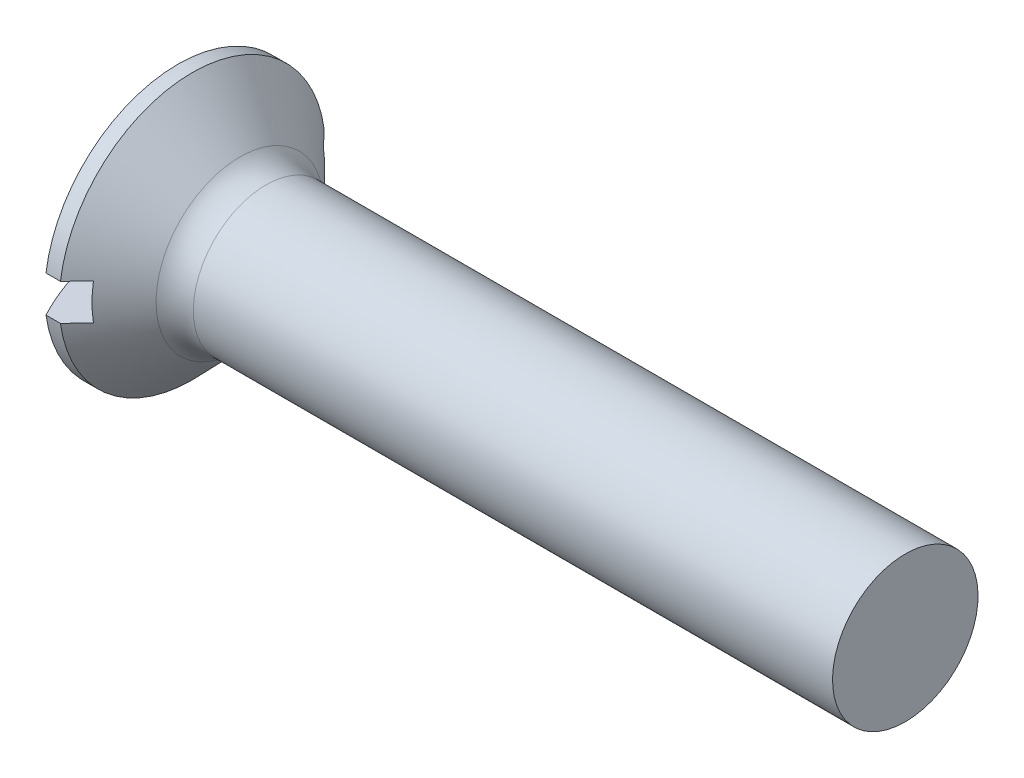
from build123d import *

# Parameters (mm, degrees)
FILLET1_R  = 2.5
SLOTSKE_W  = 18.3
SLOTSKE_H  = 2.5
SLOT_DEPTH = 4.4


with BuildPart() as part:
    # BodySke → BaseBody (revolve)
    with BuildSketch(Plane.XY, mode=Mode.PRIVATE) as basebody_sk:
        with BuildLine():
            Line((2.3, 9.15), (3.292391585, 9.15))
            Line((3.292391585, 9.15), (7.3, 5))
            Line((7.3, 5), (52.3, 5))
            Line((52.3, 5), (52.3, 0))
            Line((52.3, 0), (2.3, 0))
            Line((2.3, 0), (0, 0))
            ThreePointArc((0, 0), (0.583806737, 4.717321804), (2.3, 9.15))
        make_face()
    revolve(basebody_sk.sketch.rotate(Axis((2.3, 0, 0), (1, 0, 0)), 180), axis=Axis((2.3, 0, 0), (1, 0, 0)))

    # Fillet1
    fillet1_edges = [part.edges().sort_by_distance(p)[0] for p in [
        (7.3, 5, 0),
    ]]
    fillet(fillet1_edges, radius=FILLET1_R)

    # SlotSke → Slot (cut)
    with BuildSketch(Plane(origin=(0, 0, 0), x_dir=(0, 0, -1), z_dir=(1, 0, 0))):
        Rectangle(SLOTSKE_W, SLOTSKE_H)
    extrude(amount=SLOT_DEPTH, mode=Mode.SUBTRACT)


solid = part.part
